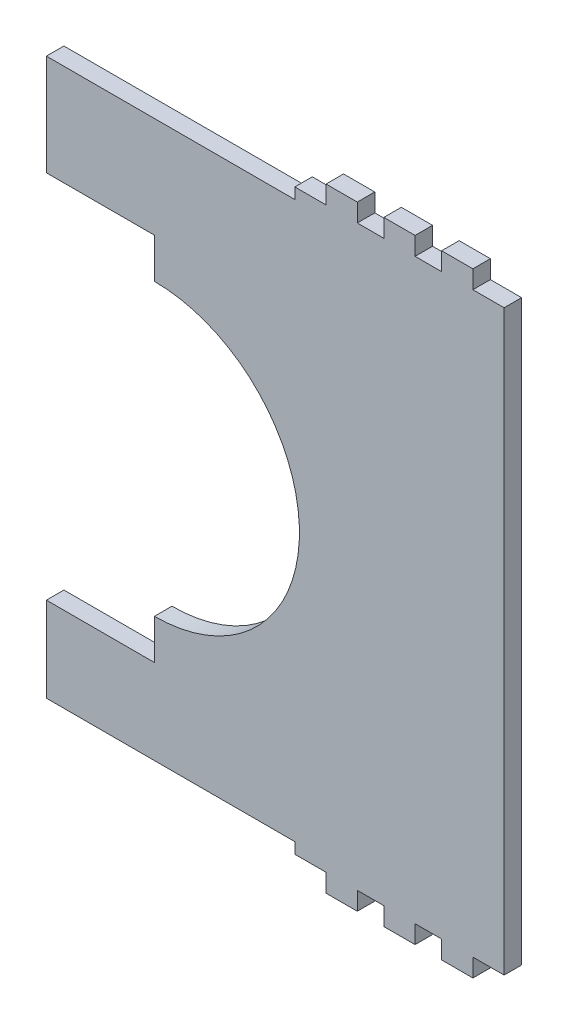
from build123d import *

# Parameters (mm, degrees)
SALIENTE_EXTRUIR1_DEPTH = 5.6


with BuildPart() as part:
    # Croquis1 → Saliente-Extruir1 (new body)
    with BuildSketch(Plane.XY):
        with BuildLine():
            Line((0, 0), (10, 0))
            Line((10, 0), (10, -5.8))
            Line((10, -5.8), (20, -5.8))
            Line((20, -5.8), (20, 0))
            Line((20, 0), (28.5, 0))
            Line((28.5, 0), (28.5, -5.8))
            Line((28.5, -5.8), (38.5, -5.8))
            Line((38.5, -5.8), (38.5, 0))
            Line((38.5, 0), (47, 0))
            Line((47, 0), (47, -5.8))
            Line((47, -5.8), (57, -5.8))
            Line((57, -5.8), (57, 0))
            Line((57, 0), (67, 0))
            Line((67, 0), (67, 185))
            Line((67, 185), (57, 185))
            Line((57, 185), (57, 190.8))
            Line((57, 190.8), (47, 190.8))
            Line((47, 190.8), (47, 185))
            Line((47, 185), (38.5, 185))
            Line((38.5, 185), (38.5, 190.8))
            Line((38.5, 190.8), (28.5, 190.8))
            Line((28.5, 190.8), (28.5, 185))
            Line((28.5, 185), (20, 185))
            Line((20, 185), (20, 190.8))
            Line((20, 190.8), (10, 190.8))
            Line((10, 190.8), (10, 185))
            Line((10, 185), (0, 185))
            Line((0, 185), (0, 181.5))
            Line((0, 181.5), (-31.673887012, 181.5))
            Line((-31.673887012, 181.5), (-79.517428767, 181.5))
            Line((-79.517428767, 181.5), (-79.517428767, 149.141774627))
            Line((-79.517428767, 149.141774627), (-44.939656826, 149.141774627))
            Line((-44.939656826, 149.141774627), (-44.939656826, 136.336604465))
            ThreePointArc((-44.939656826, 136.336604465), (1.480173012, 89.916774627), (-44.939656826, 43.496944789))
            Line((-44.939656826, 43.496944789), (-44.939656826, 30.691774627))
            Line((-44.939656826, 30.691774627), (-79.517428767, 30.691774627))
            Line((-79.517428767, 30.691774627), (-79.517428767, 3.5))
            Line((-79.517428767, 3.5), (-33.567907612, 3.5))
            Line((-33.567907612, 3.5), (0, 3.5))
            Line((0, 3.5), (0, 0))
        make_face()
    extrude(amount=SALIENTE_EXTRUIR1_DEPTH)


solid = part.part
